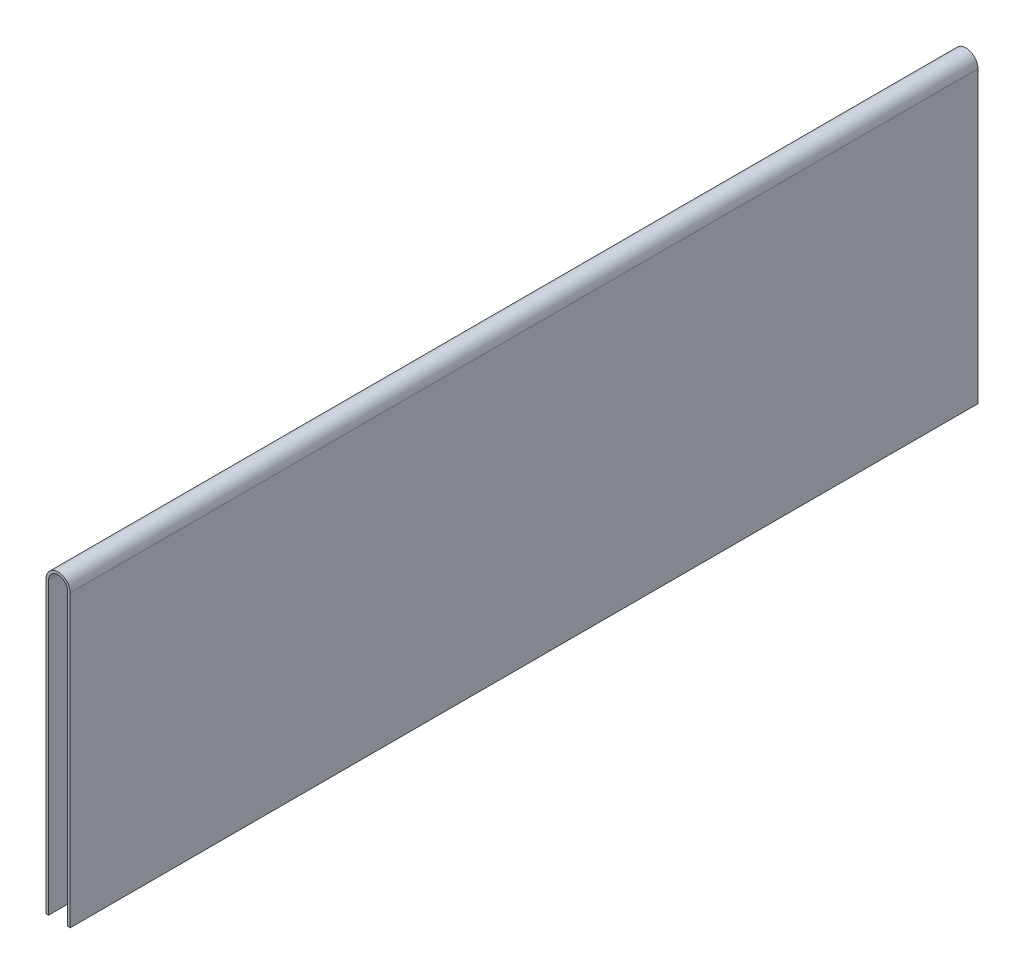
from build123d import *

# Parameters (mm, degrees)
EXTRUDE_THIN1_DEPTH = 914.4


with BuildPart() as part:
    # Sketch1 → Extrude-Thin1 (new body)
    with BuildSketch(Plane.XY):
        with BuildLine():
            Line((-9.652, -292.1), (-9.652, 0))
            ThreePointArc((-9.652, 0), (0, 9.652), (9.652, 0))
            Line((9.652, 0), (9.652, -292.1))
            Line((9.652, -292.1), (12.192, -292.1))
            Line((12.192, -292.1), (12.192, 0))
            ThreePointArc((12.192, 0), (0, 12.192), (-12.192, 0))
            Line((-12.192, 0), (-12.192, -292.1))
            Line((-12.192, -292.1), (-9.652, -292.1))
        make_face()
    extrude(amount=EXTRUDE_THIN1_DEPTH)


solid = part.part
